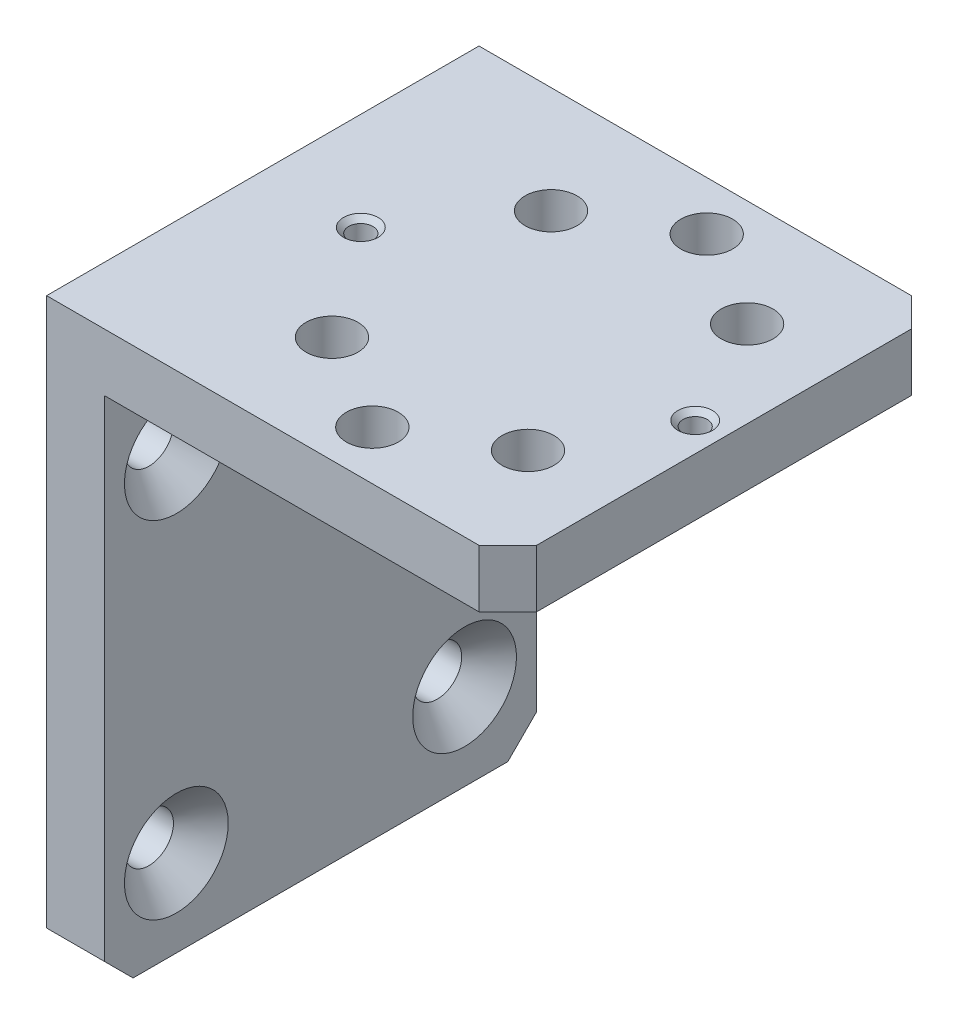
ISO-10303-21;
HEADER;
FILE_DESCRIPTION(('STEP AP214'),'2;1');
FILE_NAME('part.step','',(''),(''),'','','');
FILE_SCHEMA(('AUTOMOTIVE_DESIGN { 1 0 10303 214 1 1 1 1 }'));
ENDSEC;
DATA;
#1=APPLICATION_CONTEXT('core data for automotive mechanical design processes');
#2=APPLICATION_PROTOCOL_DEFINITION('international standard','automotive_design',2000,#1);
#3=PRODUCT_CONTEXT('',#1,'mechanical');
#4=PRODUCT('Part','Part','',(#3));
#5=PRODUCT_RELATED_PRODUCT_CATEGORY('part','',(#4));
#6=PRODUCT_DEFINITION_FORMATION('','',#4);
#7=PRODUCT_DEFINITION_CONTEXT('part definition',#1,'design');
#8=PRODUCT_DEFINITION('design','',#6,#7);
#9=PRODUCT_DEFINITION_SHAPE('','',#8);
#10=(LENGTH_UNIT() NAMED_UNIT(*) SI_UNIT(.MILLI.,.METRE.));
#11=(NAMED_UNIT(*) PLANE_ANGLE_UNIT() SI_UNIT($,.RADIAN.));
#12=(NAMED_UNIT(*) SI_UNIT($,.STERADIAN.) SOLID_ANGLE_UNIT());
#13=UNCERTAINTY_MEASURE_WITH_UNIT(LENGTH_MEASURE(1.E-05),#10,'distance_accuracy_value','');
#14=(GEOMETRIC_REPRESENTATION_CONTEXT(3) GLOBAL_UNCERTAINTY_ASSIGNED_CONTEXT((#13)) GLOBAL_UNIT_ASSIGNED_CONTEXT((#10,
#11,#12)) REPRESENTATION_CONTEXT('',''));
#15=CARTESIAN_POINT('',(0.,0.,0.));
#16=DIRECTION('',(0.,0.,1.));
#17=DIRECTION('',(1.,0.,0.));
#18=AXIS2_PLACEMENT_3D('',#15,#16,#17);
#19=CARTESIAN_POINT('',(0.,0.,37.5));
#20=DIRECTION('',(-1.,0.,0.));
#21=DIRECTION('',(0.,0.,1.));
#22=AXIS2_PLACEMENT_3D('',#19,#20,#21);
#23=PLANE('',#22);
#24=CARTESIAN_POINT('',(0.,75.,-25.));
#25=DIRECTION('',(1.,0.,0.));
#26=DIRECTION('',(0.,0.,-1.));
#27=AXIS2_PLACEMENT_3D('',#24,#25,#26);
#28=CIRCLE('',#27,4.25);
#29=CARTESIAN_POINT('',(0.,75.,-29.25));
#30=VERTEX_POINT('',#29);
#31=EDGE_CURVE('E179',#30,#30,#28,.T.);
#32=ORIENTED_EDGE('',*,*,#31,.T.);
#33=EDGE_LOOP('',(#32));
#34=FACE_BOUND('',#33,.T.);
#35=CARTESIAN_POINT('',(0.,15.,25.));
#36=DIRECTION('',(1.,0.,0.));
#37=DIRECTION('',(0.,0.,-1.));
#38=AXIS2_PLACEMENT_3D('',#35,#36,#37);
#39=CIRCLE('',#38,4.25);
#40=CARTESIAN_POINT('',(0.,15.,20.75));
#41=VERTEX_POINT('',#40);
#42=EDGE_CURVE('E197',#41,#41,#39,.T.);
#43=ORIENTED_EDGE('',*,*,#42,.T.);
#44=EDGE_LOOP('',(#43));
#45=FACE_BOUND('',#44,.T.);
#46=DIRECTION('',(0.,1.,0.));
#47=VECTOR('',#46,1.);
#48=CARTESIAN_POINT('',(0.,0.,-37.5));
#49=LINE('',#48,#47);
#50=CARTESIAN_POINT('',(0.,4.99999999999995,-37.5));
#51=VERTEX_POINT('',#50);
#52=CARTESIAN_POINT('',(0.,100.,-37.5));
#53=VERTEX_POINT('',#52);
#54=EDGE_CURVE('E210',#51,#53,#49,.T.);
#55=ORIENTED_EDGE('',*,*,#54,.F.);
#56=DIRECTION('',(0.,0.707106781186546,-0.707106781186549));
#57=VECTOR('',#56,1.);
#58=CARTESIAN_POINT('',(0.,-35.,2.50000000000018));
#59=LINE('',#58,#57);
#60=CARTESIAN_POINT('',(0.,0.,-32.5));
#61=VERTEX_POINT('',#60);
#62=EDGE_CURVE('E233',#51,#61,#59,.F.);
#63=ORIENTED_EDGE('',*,*,#62,.T.);
#64=DIRECTION('',(0.,0.,-1.));
#65=VECTOR('',#64,1.);
#66=CARTESIAN_POINT('',(0.,0.,37.5));
#67=LINE('',#66,#65);
#68=CARTESIAN_POINT('',(0.,0.,32.5));
#69=VERTEX_POINT('',#68);
#70=EDGE_CURVE('E222',#69,#61,#67,.T.);
#71=ORIENTED_EDGE('',*,*,#70,.F.);
#72=DIRECTION('',(0.,-0.707106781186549,-0.707106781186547));
#73=VECTOR('',#72,1.);
#74=CARTESIAN_POINT('',(0.,2.50000000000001,35.));
#75=LINE('',#74,#73);
#76=CARTESIAN_POINT('',(0.,5.00000000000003,37.5));
#77=VERTEX_POINT('',#76);
#78=EDGE_CURVE('E132',#69,#77,#75,.F.);
#79=ORIENTED_EDGE('',*,*,#78,.T.);
#80=DIRECTION('',(0.,1.,0.));
#81=VECTOR('',#80,1.);
#82=CARTESIAN_POINT('',(0.,0.,37.5));
#83=LINE('',#82,#81);
#84=CARTESIAN_POINT('',(0.,100.,37.5));
#85=VERTEX_POINT('',#84);
#86=EDGE_CURVE('E119',#77,#85,#83,.T.);
#87=ORIENTED_EDGE('',*,*,#86,.T.);
#88=DIRECTION('',(0.,0.,1.));
#89=VECTOR('',#88,1.);
#90=CARTESIAN_POINT('',(0.,100.,-37.5));
#91=LINE('',#90,#89);
#92=EDGE_CURVE('E130',#53,#85,#91,.T.);
#93=ORIENTED_EDGE('',*,*,#92,.F.);
#94=EDGE_LOOP('',(#55,#63,#71,#79,#87,#93));
#95=FACE_BOUND('',#94,.T.);
#96=CARTESIAN_POINT('',(0.,75.,25.));
#97=DIRECTION('',(1.,0.,0.));
#98=DIRECTION('',(0.,0.,-1.));
#99=AXIS2_PLACEMENT_3D('',#96,#97,#98);
#100=CIRCLE('',#99,4.25);
#101=CARTESIAN_POINT('',(0.,75.,20.75));
#102=VERTEX_POINT('',#101);
#103=EDGE_CURVE('E188',#102,#102,#100,.T.);
#104=ORIENTED_EDGE('',*,*,#103,.T.);
#105=EDGE_LOOP('',(#104));
#106=FACE_BOUND('',#105,.T.);
#107=CARTESIAN_POINT('',(0.,15.,-25.));
#108=DIRECTION('',(1.,0.,0.));
#109=DIRECTION('',(0.,0.,-1.));
#110=AXIS2_PLACEMENT_3D('',#107,#108,#109);
#111=CIRCLE('',#110,4.25);
#112=CARTESIAN_POINT('',(0.,15.,-29.25));
#113=VERTEX_POINT('',#112);
#114=EDGE_CURVE('E170',#113,#113,#111,.T.);
#115=ORIENTED_EDGE('',*,*,#114,.T.);
#116=EDGE_LOOP('',(#115));
#117=FACE_BOUND('',#116,.T.);
#118=ADVANCED_FACE('F38',(#34,#45,#95,#106,#117),#23,.T.);
#119=CARTESIAN_POINT('',(0.,90.,37.5));
#120=DIRECTION('',(0.,1.,0.));
#121=DIRECTION('',(0.,0.,1.));
#122=AXIS2_PLACEMENT_3D('',#119,#120,#121);
#123=PLANE('',#122);
#124=CARTESIAN_POINT('',(17.,90.,0.));
#125=DIRECTION('',(0.,1.,0.));
#126=DIRECTION('',(0.,0.,1.));
#127=AXIS2_PLACEMENT_3D('',#124,#125,#126);
#128=CIRCLE('',#127,2.09999999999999);
#129=CARTESIAN_POINT('',(17.,90.,2.09999999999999));
#130=VERTEX_POINT('',#129);
#131=EDGE_CURVE('E42',#130,#130,#128,.T.);
#132=ORIENTED_EDGE('',*,*,#131,.T.);
#133=EDGE_LOOP('',(#132));
#134=FACE_BOUND('',#133,.T.);
#135=CARTESIAN_POINT('',(75.,90.,0.));
#136=DIRECTION('',(0.,1.,0.));
#137=DIRECTION('',(0.,0.,1.));
#138=AXIS2_PLACEMENT_3D('',#135,#136,#137);
#139=CIRCLE('',#138,2.1);
#140=CARTESIAN_POINT('',(75.,90.,2.1));
#141=VERTEX_POINT('',#140);
#142=EDGE_CURVE('E259',#141,#141,#139,.T.);
#143=ORIENTED_EDGE('',*,*,#142,.T.);
#144=EDGE_LOOP('',(#143));
#145=FACE_BOUND('',#144,.T.);
#146=CARTESIAN_POINT('',(48.,90.,-29.));
#147=DIRECTION('',(0.,1.,0.));
#148=DIRECTION('',(0.,0.,1.));
#149=AXIS2_PLACEMENT_3D('',#146,#147,#148);
#150=CIRCLE('',#149,4.49999999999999);
#151=CARTESIAN_POINT('',(48.,90.,-24.5));
#152=VERTEX_POINT('',#151);
#153=EDGE_CURVE('E266',#152,#152,#150,.T.);
#154=ORIENTED_EDGE('',*,*,#153,.T.);
#155=EDGE_LOOP('',(#154));
#156=FACE_BOUND('',#155,.T.);
#157=CARTESIAN_POINT('',(48.,90.,29.));
#158=DIRECTION('',(0.,1.,0.));
#159=DIRECTION('',(0.,0.,1.));
#160=AXIS2_PLACEMENT_3D('',#157,#158,#159);
#161=CIRCLE('',#160,4.49999999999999);
#162=CARTESIAN_POINT('',(48.,90.,33.5));
#163=VERTEX_POINT('',#162);
#164=EDGE_CURVE('E140',#163,#163,#161,.T.);
#165=ORIENTED_EDGE('',*,*,#164,.T.);
#166=EDGE_LOOP('',(#165));
#167=FACE_BOUND('',#166,.T.);
#168=CARTESIAN_POINT('',(65.,90.,19.));
#169=DIRECTION('',(0.,1.,0.));
#170=DIRECTION('',(0.,0.,1.));
#171=AXIS2_PLACEMENT_3D('',#168,#169,#170);
#172=CIRCLE('',#171,4.5);
#173=CARTESIAN_POINT('',(65.,90.,23.5));
#174=VERTEX_POINT('',#173);
#175=EDGE_CURVE('E143',#174,#174,#172,.T.);
#176=ORIENTED_EDGE('',*,*,#175,.T.);
#177=EDGE_LOOP('',(#176));
#178=FACE_BOUND('',#177,.T.);
#179=CARTESIAN_POINT('',(31.,90.,19.));
#180=DIRECTION('',(0.,1.,0.));
#181=DIRECTION('',(0.,0.,1.));
#182=AXIS2_PLACEMENT_3D('',#179,#180,#181);
#183=CIRCLE('',#182,4.5);
#184=CARTESIAN_POINT('',(31.,90.,23.5));
#185=VERTEX_POINT('',#184);
#186=EDGE_CURVE('E155',#185,#185,#183,.T.);
#187=ORIENTED_EDGE('',*,*,#186,.T.);
#188=EDGE_LOOP('',(#187));
#189=FACE_BOUND('',#188,.T.);
#190=CARTESIAN_POINT('',(31.,90.,-19.));
#191=DIRECTION('',(0.,1.,0.));
#192=DIRECTION('',(0.,0.,1.));
#193=AXIS2_PLACEMENT_3D('',#190,#191,#192);
#194=CIRCLE('',#193,4.5);
#195=CARTESIAN_POINT('',(31.,90.,-14.5));
#196=VERTEX_POINT('',#195);
#197=EDGE_CURVE('E161',#196,#196,#194,.T.);
#198=ORIENTED_EDGE('',*,*,#197,.T.);
#199=EDGE_LOOP('',(#198));
#200=FACE_BOUND('',#199,.T.);
#201=CARTESIAN_POINT('',(65.,90.,-19.));
#202=DIRECTION('',(0.,1.,0.));
#203=DIRECTION('',(0.,0.,1.));
#204=AXIS2_PLACEMENT_3D('',#201,#202,#203);
#205=CIRCLE('',#204,4.5);
#206=CARTESIAN_POINT('',(65.,90.,-14.5));
#207=VERTEX_POINT('',#206);
#208=EDGE_CURVE('E167',#207,#207,#205,.T.);
#209=ORIENTED_EDGE('',*,*,#208,.T.);
#210=EDGE_LOOP('',(#209));
#211=FACE_BOUND('',#210,.T.);
#212=DIRECTION('',(1.,0.,0.));
#213=VECTOR('',#212,1.);
#214=CARTESIAN_POINT('',(0.,90.,-37.5));
#215=LINE('',#214,#213);
#216=CARTESIAN_POINT('',(10.,90.,-37.5));
#217=VERTEX_POINT('',#216);
#218=CARTESIAN_POINT('',(75.,90.,-37.5));
#219=VERTEX_POINT('',#218);
#220=EDGE_CURVE('E206',#217,#219,#215,.T.);
#221=ORIENTED_EDGE('',*,*,#220,.T.);
#222=DIRECTION('',(0.707106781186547,0.,0.707106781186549));
#223=VECTOR('',#222,1.);
#224=CARTESIAN_POINT('',(75.,90.,-37.5));
#225=LINE('',#224,#223);
#226=CARTESIAN_POINT('',(80.,90.,-32.5));
#227=VERTEX_POINT('',#226);
#228=EDGE_CURVE('E251',#219,#227,#225,.T.);
#229=ORIENTED_EDGE('',*,*,#228,.T.);
#230=DIRECTION('',(0.,0.,-1.));
#231=VECTOR('',#230,1.);
#232=CARTESIAN_POINT('',(80.,90.,37.5));
#233=LINE('',#232,#231);
#234=CARTESIAN_POINT('',(80.,90.,32.5));
#235=VERTEX_POINT('',#234);
#236=EDGE_CURVE('E227',#235,#227,#233,.T.);
#237=ORIENTED_EDGE('',*,*,#236,.F.);
#238=DIRECTION('',(0.707106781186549,0.,-0.707106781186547));
#239=VECTOR('',#238,1.);
#240=CARTESIAN_POINT('',(80.,90.,32.5));
#241=LINE('',#240,#239);
#242=CARTESIAN_POINT('',(75.,90.,37.5));
#243=VERTEX_POINT('',#242);
#244=EDGE_CURVE('E249',#235,#243,#241,.F.);
#245=ORIENTED_EDGE('',*,*,#244,.T.);
#246=DIRECTION('',(1.,0.,0.));
#247=VECTOR('',#246,1.);
#248=CARTESIAN_POINT('',(0.,90.,37.5));
#249=LINE('',#248,#247);
#250=CARTESIAN_POINT('',(10.,90.,37.5));
#251=VERTEX_POINT('',#250);
#252=EDGE_CURVE('E124',#251,#243,#249,.T.);
#253=ORIENTED_EDGE('',*,*,#252,.F.);
#254=DIRECTION('',(0.,0.,-1.));
#255=VECTOR('',#254,1.);
#256=CARTESIAN_POINT('',(10.,90.,37.5));
#257=LINE('',#256,#255);
#258=EDGE_CURVE('E216',#251,#217,#257,.T.);
#259=ORIENTED_EDGE('',*,*,#258,.T.);
#260=EDGE_LOOP('',(#221,#229,#237,#245,#253,#259));
#261=FACE_BOUND('',#260,.T.);
#262=ADVANCED_FACE('F40',(#134,#145,#156,#167,#178,#189,#200,#211,#261),#123,.F.);
#263=CARTESIAN_POINT('',(80.,100.,37.5));
#264=DIRECTION('',(1.,0.,0.));
#265=DIRECTION('',(0.,0.,-1.));
#266=AXIS2_PLACEMENT_3D('',#263,#264,#265);
#267=PLANE('',#266);
#268=ORIENTED_EDGE('',*,*,#236,.T.);
#269=DIRECTION('',(0.,1.,0.));
#270=VECTOR('',#269,1.);
#271=CARTESIAN_POINT('',(80.,100.,-32.5));
#272=LINE('',#271,#270);
#273=CARTESIAN_POINT('',(80.,100.,-32.4999999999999));
#274=VERTEX_POINT('',#273);
#275=EDGE_CURVE('E61',#227,#274,#272,.T.);
#276=ORIENTED_EDGE('',*,*,#275,.T.);
#277=DIRECTION('',(0.,0.,-1.));
#278=VECTOR('',#277,1.);
#279=CARTESIAN_POINT('',(80.,100.,37.5));
#280=LINE('',#279,#278);
#281=CARTESIAN_POINT('',(80.,100.,32.5));
#282=VERTEX_POINT('',#281);
#283=EDGE_CURVE('E225',#282,#274,#280,.T.);
#284=ORIENTED_EDGE('',*,*,#283,.F.);
#285=DIRECTION('',(0.,-1.,0.));
#286=VECTOR('',#285,1.);
#287=CARTESIAN_POINT('',(80.,100.,32.5));
#288=LINE('',#287,#286);
#289=EDGE_CURVE('E253',#282,#235,#288,.T.);
#290=ORIENTED_EDGE('',*,*,#289,.T.);
#291=EDGE_LOOP('',(#268,#276,#284,#290));
#292=FACE_BOUND('',#291,.T.);
#293=ADVANCED_FACE('F287',(#292),#267,.T.);
#294=CARTESIAN_POINT('',(0.,100.,37.5));
#295=DIRECTION('',(0.,1.,0.));
#296=DIRECTION('',(0.,0.,1.));
#297=AXIS2_PLACEMENT_3D('',#294,#295,#296);
#298=PLANE('',#297);
#299=CARTESIAN_POINT('',(17.,100.,0.));
#300=DIRECTION('',(0.,1.,0.));
#301=DIRECTION('',(0.,0.,1.));
#302=AXIS2_PLACEMENT_3D('',#299,#300,#301);
#303=CIRCLE('',#302,3.);
#304=CARTESIAN_POINT('',(17.,100.,3.));
#305=VERTEX_POINT('',#304);
#306=EDGE_CURVE('E558',#305,#305,#303,.T.);
#307=ORIENTED_EDGE('',*,*,#306,.F.);
#308=EDGE_LOOP('',(#307));
#309=FACE_BOUND('',#308,.T.);
#310=CARTESIAN_POINT('',(75.,100.,0.));
#311=DIRECTION('',(0.,1.,0.));
#312=DIRECTION('',(0.,0.,1.));
#313=AXIS2_PLACEMENT_3D('',#310,#311,#312);
#314=CIRCLE('',#313,3.);
#315=CARTESIAN_POINT('',(75.,100.,3.));
#316=VERTEX_POINT('',#315);
#317=EDGE_CURVE('E262',#316,#316,#314,.T.);
#318=ORIENTED_EDGE('',*,*,#317,.F.);
#319=EDGE_LOOP('',(#318));
#320=FACE_BOUND('',#319,.T.);
#321=CARTESIAN_POINT('',(48.,100.,-29.));
#322=DIRECTION('',(0.,1.,0.));
#323=DIRECTION('',(0.,0.,1.));
#324=AXIS2_PLACEMENT_3D('',#321,#322,#323);
#325=CIRCLE('',#324,4.49999999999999);
#326=CARTESIAN_POINT('',(48.,100.,-24.5));
#327=VERTEX_POINT('',#326);
#328=EDGE_CURVE('E261',#327,#327,#325,.T.);
#329=ORIENTED_EDGE('',*,*,#328,.F.);
#330=EDGE_LOOP('',(#329));
#331=FACE_BOUND('',#330,.T.);
#332=CARTESIAN_POINT('',(48.,100.,29.));
#333=DIRECTION('',(0.,1.,0.));
#334=DIRECTION('',(0.,0.,1.));
#335=AXIS2_PLACEMENT_3D('',#332,#333,#334);
#336=CIRCLE('',#335,4.49999999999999);
#337=CARTESIAN_POINT('',(48.,100.,33.5));
#338=VERTEX_POINT('',#337);
#339=EDGE_CURVE('E146',#338,#338,#336,.T.);
#340=ORIENTED_EDGE('',*,*,#339,.F.);
#341=EDGE_LOOP('',(#340));
#342=FACE_BOUND('',#341,.T.);
#343=CARTESIAN_POINT('',(65.,100.,19.));
#344=DIRECTION('',(0.,1.,0.));
#345=DIRECTION('',(0.,0.,1.));
#346=AXIS2_PLACEMENT_3D('',#343,#344,#345);
#347=CIRCLE('',#346,4.5);
#348=CARTESIAN_POINT('',(65.,100.,23.5));
#349=VERTEX_POINT('',#348);
#350=EDGE_CURVE('E139',#349,#349,#347,.T.);
#351=ORIENTED_EDGE('',*,*,#350,.F.);
#352=EDGE_LOOP('',(#351));
#353=FACE_BOUND('',#352,.T.);
#354=CARTESIAN_POINT('',(31.,100.,19.));
#355=DIRECTION('',(0.,1.,0.));
#356=DIRECTION('',(0.,0.,1.));
#357=AXIS2_PLACEMENT_3D('',#354,#355,#356);
#358=CIRCLE('',#357,4.5);
#359=CARTESIAN_POINT('',(31.,100.,23.5));
#360=VERTEX_POINT('',#359);
#361=EDGE_CURVE('E152',#360,#360,#358,.T.);
#362=ORIENTED_EDGE('',*,*,#361,.F.);
#363=EDGE_LOOP('',(#362));
#364=FACE_BOUND('',#363,.T.);
#365=CARTESIAN_POINT('',(31.,100.,-19.));
#366=DIRECTION('',(0.,1.,0.));
#367=DIRECTION('',(0.,0.,1.));
#368=AXIS2_PLACEMENT_3D('',#365,#366,#367);
#369=CIRCLE('',#368,4.5);
#370=CARTESIAN_POINT('',(31.,100.,-14.5));
#371=VERTEX_POINT('',#370);
#372=EDGE_CURVE('E158',#371,#371,#369,.T.);
#373=ORIENTED_EDGE('',*,*,#372,.F.);
#374=EDGE_LOOP('',(#373));
#375=FACE_BOUND('',#374,.T.);
#376=CARTESIAN_POINT('',(65.,100.,-19.));
#377=DIRECTION('',(0.,1.,0.));
#378=DIRECTION('',(0.,0.,1.));
#379=AXIS2_PLACEMENT_3D('',#376,#377,#378);
#380=CIRCLE('',#379,4.5);
#381=CARTESIAN_POINT('',(65.,100.,-14.5));
#382=VERTEX_POINT('',#381);
#383=EDGE_CURVE('E164',#382,#382,#380,.T.);
#384=ORIENTED_EDGE('',*,*,#383,.F.);
#385=EDGE_LOOP('',(#384));
#386=FACE_BOUND('',#385,.T.);
#387=ORIENTED_EDGE('',*,*,#283,.T.);
#388=DIRECTION('',(-0.707106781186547,0.,-0.707106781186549));
#389=VECTOR('',#388,1.);
#390=CARTESIAN_POINT('',(75.0000000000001,100.,-37.4999999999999));
#391=LINE('',#390,#389);
#392=CARTESIAN_POINT('',(75.,100.,-37.5));
#393=VERTEX_POINT('',#392);
#394=EDGE_CURVE('E47',#274,#393,#391,.T.);
#395=ORIENTED_EDGE('',*,*,#394,.T.);
#396=DIRECTION('',(1.,0.,0.));
#397=VECTOR('',#396,1.);
#398=CARTESIAN_POINT('',(0.,100.,-37.5));
#399=LINE('',#398,#397);
#400=EDGE_CURVE('E138',#53,#393,#399,.T.);
#401=ORIENTED_EDGE('',*,*,#400,.F.);
#402=ORIENTED_EDGE('',*,*,#92,.T.);
#403=DIRECTION('',(1.,0.,0.));
#404=VECTOR('',#403,1.);
#405=CARTESIAN_POINT('',(0.,100.,37.5));
#406=LINE('',#405,#404);
#407=CARTESIAN_POINT('',(75.,100.,37.5));
#408=VERTEX_POINT('',#407);
#409=EDGE_CURVE('E116',#85,#408,#406,.T.);
#410=ORIENTED_EDGE('',*,*,#409,.T.);
#411=DIRECTION('',(-0.707106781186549,0.,0.707106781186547));
#412=VECTOR('',#411,1.);
#413=CARTESIAN_POINT('',(37.4999999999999,100.,75.));
#414=LINE('',#413,#412);
#415=EDGE_CURVE('E257',#408,#282,#414,.F.);
#416=ORIENTED_EDGE('',*,*,#415,.T.);
#417=EDGE_LOOP('',(#387,#395,#401,#402,#410,#416));
#418=FACE_BOUND('',#417,.T.);
#419=ADVANCED_FACE('F136',(#309,#320,#331,#342,#353,#364,#375,#386,#418),#298,.T.);
#420=CARTESIAN_POINT('',(10.,0.,37.5));
#421=DIRECTION('',(0.,-1.,0.));
#422=DIRECTION('',(0.,0.,-1.));
#423=AXIS2_PLACEMENT_3D('',#420,#421,#422);
#424=PLANE('',#423);
#425=ORIENTED_EDGE('',*,*,#70,.T.);
#426=DIRECTION('',(1.,0.,0.));
#427=VECTOR('',#426,1.);
#428=CARTESIAN_POINT('',(10.,0.,-32.5));
#429=LINE('',#428,#427);
#430=CARTESIAN_POINT('',(10.,0.,-32.5));
#431=VERTEX_POINT('',#430);
#432=EDGE_CURVE('E238',#61,#431,#429,.T.);
#433=ORIENTED_EDGE('',*,*,#432,.T.);
#434=DIRECTION('',(0.,0.,-1.));
#435=VECTOR('',#434,1.);
#436=CARTESIAN_POINT('',(10.,0.,37.5));
#437=LINE('',#436,#435);
#438=CARTESIAN_POINT('',(10.,0.,32.5));
#439=VERTEX_POINT('',#438);
#440=EDGE_CURVE('E219',#439,#431,#437,.T.);
#441=ORIENTED_EDGE('',*,*,#440,.F.);
#442=DIRECTION('',(-1.,0.,0.));
#443=VECTOR('',#442,1.);
#444=CARTESIAN_POINT('',(10.,0.,32.5));
#445=LINE('',#444,#443);
#446=EDGE_CURVE('E235',#439,#69,#445,.T.);
#447=ORIENTED_EDGE('',*,*,#446,.T.);
#448=EDGE_LOOP('',(#425,#433,#441,#447));
#449=FACE_BOUND('',#448,.T.);
#450=ADVANCED_FACE('F286',(#449),#424,.T.);
#451=CARTESIAN_POINT('',(10.,0.,37.5));
#452=DIRECTION('',(-1.,0.,0.));
#453=DIRECTION('',(0.,0.,1.));
#454=AXIS2_PLACEMENT_3D('',#451,#452,#453);
#455=PLANE('',#454);
#456=CARTESIAN_POINT('',(10.,15.,-25.));
#457=DIRECTION('',(1.,0.,0.));
#458=DIRECTION('',(0.,0.,-1.));
#459=AXIS2_PLACEMENT_3D('',#456,#457,#458);
#460=CIRCLE('',#459,9.);
#461=CARTESIAN_POINT('',(10.,15.,-34.));
#462=VERTEX_POINT('',#461);
#463=EDGE_CURVE('E176',#462,#462,#460,.T.);
#464=ORIENTED_EDGE('',*,*,#463,.F.);
#465=EDGE_LOOP('',(#464));
#466=FACE_BOUND('',#465,.T.);
#467=CARTESIAN_POINT('',(10.,75.,-25.));
#468=DIRECTION('',(1.,0.,0.));
#469=DIRECTION('',(0.,0.,-1.));
#470=AXIS2_PLACEMENT_3D('',#467,#468,#469);
#471=CIRCLE('',#470,8.99999999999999);
#472=CARTESIAN_POINT('',(10.,75.,-34.));
#473=VERTEX_POINT('',#472);
#474=EDGE_CURVE('E185',#473,#473,#471,.T.);
#475=ORIENTED_EDGE('',*,*,#474,.F.);
#476=EDGE_LOOP('',(#475));
#477=FACE_BOUND('',#476,.T.);
#478=CARTESIAN_POINT('',(10.,75.,25.));
#479=DIRECTION('',(1.,0.,0.));
#480=DIRECTION('',(0.,0.,-1.));
#481=AXIS2_PLACEMENT_3D('',#478,#479,#480);
#482=CIRCLE('',#481,8.99999999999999);
#483=CARTESIAN_POINT('',(10.,75.,16.));
#484=VERTEX_POINT('',#483);
#485=EDGE_CURVE('E194',#484,#484,#482,.T.);
#486=ORIENTED_EDGE('',*,*,#485,.F.);
#487=EDGE_LOOP('',(#486));
#488=FACE_BOUND('',#487,.T.);
#489=CARTESIAN_POINT('',(10.,15.,25.));
#490=DIRECTION('',(1.,0.,0.));
#491=DIRECTION('',(0.,0.,-1.));
#492=AXIS2_PLACEMENT_3D('',#489,#490,#491);
#493=CIRCLE('',#492,9.);
#494=CARTESIAN_POINT('',(10.,15.,16.));
#495=VERTEX_POINT('',#494);
#496=EDGE_CURVE('E203',#495,#495,#493,.T.);
#497=ORIENTED_EDGE('',*,*,#496,.F.);
#498=EDGE_LOOP('',(#497));
#499=FACE_BOUND('',#498,.T.);
#500=ORIENTED_EDGE('',*,*,#440,.T.);
#501=DIRECTION('',(0.,-0.707106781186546,0.707106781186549));
#502=VECTOR('',#501,1.);
#503=CARTESIAN_POINT('',(10.,4.99999999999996,-37.5));
#504=LINE('',#503,#502);
#505=CARTESIAN_POINT('',(10.,4.99999999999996,-37.5));
#506=VERTEX_POINT('',#505);
#507=EDGE_CURVE('E242',#431,#506,#504,.F.);
#508=ORIENTED_EDGE('',*,*,#507,.T.);
#509=DIRECTION('',(0.,1.,0.));
#510=VECTOR('',#509,1.);
#511=CARTESIAN_POINT('',(10.,0.,-37.5));
#512=LINE('',#511,#510);
#513=EDGE_CURVE('E212',#506,#217,#512,.T.);
#514=ORIENTED_EDGE('',*,*,#513,.T.);
#515=ORIENTED_EDGE('',*,*,#258,.F.);
#516=DIRECTION('',(0.,1.,0.));
#517=VECTOR('',#516,1.);
#518=CARTESIAN_POINT('',(10.,0.,37.5));
#519=LINE('',#518,#517);
#520=CARTESIAN_POINT('',(10.,5.00000000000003,37.5));
#521=VERTEX_POINT('',#520);
#522=EDGE_CURVE('E133',#521,#251,#519,.T.);
#523=ORIENTED_EDGE('',*,*,#522,.F.);
#524=DIRECTION('',(0.,0.707106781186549,0.707106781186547));
#525=VECTOR('',#524,1.);
#526=CARTESIAN_POINT('',(10.,0.,32.5));
#527=LINE('',#526,#525);
#528=EDGE_CURVE('E240',#521,#439,#527,.F.);
#529=ORIENTED_EDGE('',*,*,#528,.T.);
#530=EDGE_LOOP('',(#500,#508,#514,#515,#523,#529));
#531=FACE_BOUND('',#530,.T.);
#532=ADVANCED_FACE('F348',(#466,#477,#488,#499,#531),#455,.F.);
#533=CARTESIAN_POINT('',(10.,90.,37.5));
#534=DIRECTION('',(0.,0.,1.));
#535=DIRECTION('',(1.,0.,0.));
#536=AXIS2_PLACEMENT_3D('',#533,#534,#535);
#537=PLANE('',#536);
#538=ORIENTED_EDGE('',*,*,#86,.F.);
#539=DIRECTION('',(1.,0.,0.));
#540=VECTOR('',#539,1.);
#541=CARTESIAN_POINT('',(10.,5.00000000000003,37.5));
#542=LINE('',#541,#540);
#543=EDGE_CURVE('E244',#77,#521,#542,.T.);
#544=ORIENTED_EDGE('',*,*,#543,.T.);
#545=ORIENTED_EDGE('',*,*,#522,.T.);
#546=ORIENTED_EDGE('',*,*,#252,.T.);
#547=DIRECTION('',(0.,1.,0.));
#548=VECTOR('',#547,1.);
#549=CARTESIAN_POINT('',(75.,90.,37.5));
#550=LINE('',#549,#548);
#551=EDGE_CURVE('E11',#243,#408,#550,.T.);
#552=ORIENTED_EDGE('',*,*,#551,.T.);
#553=ORIENTED_EDGE('',*,*,#409,.F.);
#554=EDGE_LOOP('',(#538,#544,#545,#546,#552,#553));
#555=FACE_BOUND('',#554,.T.);
#556=ADVANCED_FACE('F118',(#555),#537,.T.);
#557=CARTESIAN_POINT('',(10.,90.,-37.5));
#558=DIRECTION('',(0.,0.,1.));
#559=DIRECTION('',(1.,0.,0.));
#560=AXIS2_PLACEMENT_3D('',#557,#558,#559);
#561=PLANE('',#560);
#562=ORIENTED_EDGE('',*,*,#400,.T.);
#563=DIRECTION('',(0.,-1.,0.));
#564=VECTOR('',#563,1.);
#565=CARTESIAN_POINT('',(75.,90.,-37.5));
#566=LINE('',#565,#564);
#567=EDGE_CURVE('E246',#393,#219,#566,.T.);
#568=ORIENTED_EDGE('',*,*,#567,.T.);
#569=ORIENTED_EDGE('',*,*,#220,.F.);
#570=ORIENTED_EDGE('',*,*,#513,.F.);
#571=DIRECTION('',(-1.,0.,0.));
#572=VECTOR('',#571,1.);
#573=CARTESIAN_POINT('',(10.,4.99999999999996,-37.5));
#574=LINE('',#573,#572);
#575=EDGE_CURVE('E229',#506,#51,#574,.T.);
#576=ORIENTED_EDGE('',*,*,#575,.T.);
#577=ORIENTED_EDGE('',*,*,#54,.T.);
#578=EDGE_LOOP('',(#562,#568,#569,#570,#576,#577));
#579=FACE_BOUND('',#578,.T.);
#580=ADVANCED_FACE('F336',(#579),#561,.F.);
#581=CARTESIAN_POINT('',(10.,4.99999999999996,-37.5));
#582=DIRECTION('',(0.,0.707106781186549,0.707106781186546));
#583=DIRECTION('',(0.,-0.707106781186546,0.707106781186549));
#584=AXIS2_PLACEMENT_3D('',#581,#582,#583);
#585=PLANE('',#584);
#586=ORIENTED_EDGE('',*,*,#507,.F.);
#587=ORIENTED_EDGE('',*,*,#432,.F.);
#588=ORIENTED_EDGE('',*,*,#62,.F.);
#589=ORIENTED_EDGE('',*,*,#575,.F.);
#590=EDGE_LOOP('',(#586,#587,#588,#589));
#591=FACE_BOUND('',#590,.T.);
#592=ADVANCED_FACE('F346',(#591),#585,.F.);
#593=CARTESIAN_POINT('',(10.,0.,32.5));
#594=DIRECTION('',(0.,0.707106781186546,-0.707106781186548));
#595=DIRECTION('',(0.,0.707106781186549,0.707106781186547));
#596=AXIS2_PLACEMENT_3D('',#593,#594,#595);
#597=PLANE('',#596);
#598=ORIENTED_EDGE('',*,*,#528,.F.);
#599=ORIENTED_EDGE('',*,*,#543,.F.);
#600=ORIENTED_EDGE('',*,*,#78,.F.);
#601=ORIENTED_EDGE('',*,*,#446,.F.);
#602=EDGE_LOOP('',(#598,#599,#600,#601));
#603=FACE_BOUND('',#602,.T.);
#604=ADVANCED_FACE('F354',(#603),#597,.F.);
#605=CARTESIAN_POINT('',(75.,90.,-37.5));
#606=DIRECTION('',(0.707106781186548,0.,-0.707106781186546));
#607=DIRECTION('',(-0.707106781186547,0.,-0.707106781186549));
#608=AXIS2_PLACEMENT_3D('',#605,#606,#607);
#609=PLANE('',#608);
#610=ORIENTED_EDGE('',*,*,#394,.F.);
#611=ORIENTED_EDGE('',*,*,#275,.F.);
#612=ORIENTED_EDGE('',*,*,#228,.F.);
#613=ORIENTED_EDGE('',*,*,#567,.F.);
#614=EDGE_LOOP('',(#610,#611,#612,#613));
#615=FACE_BOUND('',#614,.T.);
#616=ADVANCED_FACE('F333',(#615),#609,.T.);
#617=CARTESIAN_POINT('',(80.,100.,32.5));
#618=DIRECTION('',(-0.707106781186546,0.,-0.707106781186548));
#619=DIRECTION('',(-0.707106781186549,0.,0.707106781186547));
#620=AXIS2_PLACEMENT_3D('',#617,#618,#619);
#621=PLANE('',#620);
#622=ORIENTED_EDGE('',*,*,#415,.F.);
#623=ORIENTED_EDGE('',*,*,#551,.F.);
#624=ORIENTED_EDGE('',*,*,#244,.F.);
#625=ORIENTED_EDGE('',*,*,#289,.F.);
#626=EDGE_LOOP('',(#622,#623,#624,#625));
#627=FACE_BOUND('',#626,.T.);
#628=ADVANCED_FACE('F361',(#627),#621,.F.);
#629=CARTESIAN_POINT('',(10.,15.,25.));
#630=DIRECTION('',(1.,0.,0.));
#631=DIRECTION('',(0.,0.,-1.));
#632=AXIS2_PLACEMENT_3D('',#629,#630,#631);
#633=CONICAL_SURFACE('',#632,9.,0.785398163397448);
#634=CARTESIAN_POINT('',(5.25,15.,25.));
#635=DIRECTION('',(1.,0.,0.));
#636=DIRECTION('',(0.,0.,-1.));
#637=AXIS2_PLACEMENT_3D('',#634,#635,#636);
#638=CIRCLE('',#637,4.25);
#639=CARTESIAN_POINT('',(5.25,15.,20.75));
#640=VERTEX_POINT('',#639);
#641=EDGE_CURVE('E200',#640,#640,#638,.T.);
#642=ORIENTED_EDGE('',*,*,#641,.F.);
#643=EDGE_LOOP('',(#642));
#644=FACE_BOUND('',#643,.T.);
#645=ORIENTED_EDGE('',*,*,#496,.T.);
#646=EDGE_LOOP('',(#645));
#647=FACE_BOUND('',#646,.T.);
#648=ADVANCED_FACE('F382',(#644,#647),#633,.F.);
#649=CARTESIAN_POINT('',(10.,15.,25.));
#650=DIRECTION('',(1.,0.,0.));
#651=DIRECTION('',(0.,0.,-1.));
#652=AXIS2_PLACEMENT_3D('',#649,#650,#651);
#653=CYLINDRICAL_SURFACE('',#652,4.25);
#654=ORIENTED_EDGE('',*,*,#42,.F.);
#655=EDGE_LOOP('',(#654));
#656=FACE_BOUND('',#655,.T.);
#657=ORIENTED_EDGE('',*,*,#641,.T.);
#658=EDGE_LOOP('',(#657));
#659=FACE_BOUND('',#658,.T.);
#660=ADVANCED_FACE('F384',(#656,#659),#653,.F.);
#661=CARTESIAN_POINT('',(10.,75.,25.));
#662=DIRECTION('',(1.,0.,0.));
#663=DIRECTION('',(0.,0.,-1.));
#664=AXIS2_PLACEMENT_3D('',#661,#662,#663);
#665=CONICAL_SURFACE('',#664,8.99999999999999,0.785398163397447);
#666=CARTESIAN_POINT('',(5.25,75.,25.));
#667=DIRECTION('',(1.,0.,0.));
#668=DIRECTION('',(0.,0.,-1.));
#669=AXIS2_PLACEMENT_3D('',#666,#667,#668);
#670=CIRCLE('',#669,4.25);
#671=CARTESIAN_POINT('',(5.25,75.,20.75));
#672=VERTEX_POINT('',#671);
#673=EDGE_CURVE('E191',#672,#672,#670,.T.);
#674=ORIENTED_EDGE('',*,*,#673,.F.);
#675=EDGE_LOOP('',(#674));
#676=FACE_BOUND('',#675,.T.);
#677=ORIENTED_EDGE('',*,*,#485,.T.);
#678=EDGE_LOOP('',(#677));
#679=FACE_BOUND('',#678,.T.);
#680=ADVANCED_FACE('F391',(#676,#679),#665,.F.);
#681=CARTESIAN_POINT('',(10.,75.,25.));
#682=DIRECTION('',(1.,0.,0.));
#683=DIRECTION('',(0.,0.,-1.));
#684=AXIS2_PLACEMENT_3D('',#681,#682,#683);
#685=CYLINDRICAL_SURFACE('',#684,4.25);
#686=ORIENTED_EDGE('',*,*,#103,.F.);
#687=EDGE_LOOP('',(#686));
#688=FACE_BOUND('',#687,.T.);
#689=ORIENTED_EDGE('',*,*,#673,.T.);
#690=EDGE_LOOP('',(#689));
#691=FACE_BOUND('',#690,.T.);
#692=ADVANCED_FACE('F399',(#688,#691),#685,.F.);
#693=CARTESIAN_POINT('',(10.,75.,-25.));
#694=DIRECTION('',(1.,0.,0.));
#695=DIRECTION('',(0.,0.,-1.));
#696=AXIS2_PLACEMENT_3D('',#693,#694,#695);
#697=CONICAL_SURFACE('',#696,8.99999999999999,0.785398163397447);
#698=CARTESIAN_POINT('',(5.25,75.,-25.));
#699=DIRECTION('',(1.,0.,0.));
#700=DIRECTION('',(0.,0.,-1.));
#701=AXIS2_PLACEMENT_3D('',#698,#699,#700);
#702=CIRCLE('',#701,4.25);
#703=CARTESIAN_POINT('',(5.25,75.,-29.25));
#704=VERTEX_POINT('',#703);
#705=EDGE_CURVE('E182',#704,#704,#702,.T.);
#706=ORIENTED_EDGE('',*,*,#705,.F.);
#707=EDGE_LOOP('',(#706));
#708=FACE_BOUND('',#707,.T.);
#709=ORIENTED_EDGE('',*,*,#474,.T.);
#710=EDGE_LOOP('',(#709));
#711=FACE_BOUND('',#710,.T.);
#712=ADVANCED_FACE('F403',(#708,#711),#697,.F.);
#713=CARTESIAN_POINT('',(10.,75.,-25.));
#714=DIRECTION('',(1.,0.,0.));
#715=DIRECTION('',(0.,0.,-1.));
#716=AXIS2_PLACEMENT_3D('',#713,#714,#715);
#717=CYLINDRICAL_SURFACE('',#716,4.25);
#718=ORIENTED_EDGE('',*,*,#31,.F.);
#719=EDGE_LOOP('',(#718));
#720=FACE_BOUND('',#719,.T.);
#721=ORIENTED_EDGE('',*,*,#705,.T.);
#722=EDGE_LOOP('',(#721));
#723=FACE_BOUND('',#722,.T.);
#724=ADVANCED_FACE('F407',(#720,#723),#717,.F.);
#725=CARTESIAN_POINT('',(10.,15.,-25.));
#726=DIRECTION('',(1.,0.,0.));
#727=DIRECTION('',(0.,0.,-1.));
#728=AXIS2_PLACEMENT_3D('',#725,#726,#727);
#729=CONICAL_SURFACE('',#728,9.,0.785398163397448);
#730=CARTESIAN_POINT('',(5.25,15.,-25.));
#731=DIRECTION('',(1.,0.,0.));
#732=DIRECTION('',(0.,0.,-1.));
#733=AXIS2_PLACEMENT_3D('',#730,#731,#732);
#734=CIRCLE('',#733,4.25);
#735=CARTESIAN_POINT('',(5.25,15.,-29.25));
#736=VERTEX_POINT('',#735);
#737=EDGE_CURVE('E173',#736,#736,#734,.T.);
#738=ORIENTED_EDGE('',*,*,#737,.F.);
#739=EDGE_LOOP('',(#738));
#740=FACE_BOUND('',#739,.T.);
#741=ORIENTED_EDGE('',*,*,#463,.T.);
#742=EDGE_LOOP('',(#741));
#743=FACE_BOUND('',#742,.T.);
#744=ADVANCED_FACE('F311',(#740,#743),#729,.F.);
#745=CARTESIAN_POINT('',(10.,15.,-25.));
#746=DIRECTION('',(1.,0.,0.));
#747=DIRECTION('',(0.,0.,-1.));
#748=AXIS2_PLACEMENT_3D('',#745,#746,#747);
#749=CYLINDRICAL_SURFACE('',#748,4.25);
#750=ORIENTED_EDGE('',*,*,#114,.F.);
#751=EDGE_LOOP('',(#750));
#752=FACE_BOUND('',#751,.T.);
#753=ORIENTED_EDGE('',*,*,#737,.T.);
#754=EDGE_LOOP('',(#753));
#755=FACE_BOUND('',#754,.T.);
#756=ADVANCED_FACE('F301',(#752,#755),#749,.F.);
#757=CARTESIAN_POINT('',(65.,100.,-19.));
#758=DIRECTION('',(0.,1.,0.));
#759=DIRECTION('',(0.,0.,1.));
#760=AXIS2_PLACEMENT_3D('',#757,#758,#759);
#761=CYLINDRICAL_SURFACE('',#760,4.5);
#762=ORIENTED_EDGE('',*,*,#208,.F.);
#763=EDGE_LOOP('',(#762));
#764=FACE_BOUND('',#763,.T.);
#765=ORIENTED_EDGE('',*,*,#383,.T.);
#766=EDGE_LOOP('',(#765));
#767=FACE_BOUND('',#766,.T.);
#768=ADVANCED_FACE('F298',(#764,#767),#761,.F.);
#769=CARTESIAN_POINT('',(31.,100.,-19.));
#770=DIRECTION('',(0.,1.,0.));
#771=DIRECTION('',(0.,0.,1.));
#772=AXIS2_PLACEMENT_3D('',#769,#770,#771);
#773=CYLINDRICAL_SURFACE('',#772,4.5);
#774=ORIENTED_EDGE('',*,*,#197,.F.);
#775=EDGE_LOOP('',(#774));
#776=FACE_BOUND('',#775,.T.);
#777=ORIENTED_EDGE('',*,*,#372,.T.);
#778=EDGE_LOOP('',(#777));
#779=FACE_BOUND('',#778,.T.);
#780=ADVANCED_FACE('F300',(#776,#779),#773,.F.);
#781=CARTESIAN_POINT('',(31.,100.,19.));
#782=DIRECTION('',(0.,1.,0.));
#783=DIRECTION('',(0.,0.,1.));
#784=AXIS2_PLACEMENT_3D('',#781,#782,#783);
#785=CYLINDRICAL_SURFACE('',#784,4.5);
#786=ORIENTED_EDGE('',*,*,#186,.F.);
#787=EDGE_LOOP('',(#786));
#788=FACE_BOUND('',#787,.T.);
#789=ORIENTED_EDGE('',*,*,#361,.T.);
#790=EDGE_LOOP('',(#789));
#791=FACE_BOUND('',#790,.T.);
#792=ADVANCED_FACE('F308',(#788,#791),#785,.F.);
#793=CARTESIAN_POINT('',(65.,100.,19.));
#794=DIRECTION('',(0.,1.,0.));
#795=DIRECTION('',(0.,0.,1.));
#796=AXIS2_PLACEMENT_3D('',#793,#794,#795);
#797=CYLINDRICAL_SURFACE('',#796,4.5);
#798=ORIENTED_EDGE('',*,*,#175,.F.);
#799=EDGE_LOOP('',(#798));
#800=FACE_BOUND('',#799,.T.);
#801=ORIENTED_EDGE('',*,*,#350,.T.);
#802=EDGE_LOOP('',(#801));
#803=FACE_BOUND('',#802,.T.);
#804=ADVANCED_FACE('F444',(#800,#803),#797,.F.);
#805=CARTESIAN_POINT('',(48.,100.,29.));
#806=DIRECTION('',(0.,1.,0.));
#807=DIRECTION('',(0.,0.,1.));
#808=AXIS2_PLACEMENT_3D('',#805,#806,#807);
#809=CYLINDRICAL_SURFACE('',#808,4.49999999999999);
#810=ORIENTED_EDGE('',*,*,#339,.T.);
#811=EDGE_LOOP('',(#810));
#812=FACE_BOUND('',#811,.T.);
#813=ORIENTED_EDGE('',*,*,#164,.F.);
#814=EDGE_LOOP('',(#813));
#815=FACE_BOUND('',#814,.T.);
#816=ADVANCED_FACE('F281',(#812,#815),#809,.F.);
#817=CARTESIAN_POINT('',(48.,100.,-29.));
#818=DIRECTION('',(0.,1.,0.));
#819=DIRECTION('',(0.,0.,1.));
#820=AXIS2_PLACEMENT_3D('',#817,#818,#819);
#821=CYLINDRICAL_SURFACE('',#820,4.49999999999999);
#822=ORIENTED_EDGE('',*,*,#328,.T.);
#823=EDGE_LOOP('',(#822));
#824=FACE_BOUND('',#823,.T.);
#825=ORIENTED_EDGE('',*,*,#153,.F.);
#826=EDGE_LOOP('',(#825));
#827=FACE_BOUND('',#826,.T.);
#828=ADVANCED_FACE('F485',(#824,#827),#821,.F.);
#829=CARTESIAN_POINT('',(75.,100.,0.));
#830=DIRECTION('',(0.,1.,0.));
#831=DIRECTION('',(0.,0.,1.));
#832=AXIS2_PLACEMENT_3D('',#829,#830,#831);
#833=CYLINDRICAL_SURFACE('',#832,2.1);
#834=CARTESIAN_POINT('',(75.,99.1,0.));
#835=DIRECTION('',(0.,1.,0.));
#836=DIRECTION('',(0.,0.,1.));
#837=AXIS2_PLACEMENT_3D('',#834,#835,#836);
#838=CIRCLE('',#837,2.1);
#839=CARTESIAN_POINT('',(75.,99.1,2.1));
#840=VERTEX_POINT('',#839);
#841=EDGE_CURVE('E269',#840,#840,#838,.T.);
#842=ORIENTED_EDGE('',*,*,#841,.T.);
#843=EDGE_LOOP('',(#842));
#844=FACE_BOUND('',#843,.T.);
#845=ORIENTED_EDGE('',*,*,#142,.F.);
#846=EDGE_LOOP('',(#845));
#847=FACE_BOUND('',#846,.T.);
#848=ADVANCED_FACE('F494',(#844,#847),#833,.F.);
#849=CARTESIAN_POINT('',(75.,100.,0.));
#850=DIRECTION('',(0.,1.,0.));
#851=DIRECTION('',(0.,0.,1.));
#852=AXIS2_PLACEMENT_3D('',#849,#850,#851);
#853=CONICAL_SURFACE('',#852,3.,0.785398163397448);
#854=ORIENTED_EDGE('',*,*,#841,.F.);
#855=EDGE_LOOP('',(#854));
#856=FACE_BOUND('',#855,.T.);
#857=ORIENTED_EDGE('',*,*,#317,.T.);
#858=EDGE_LOOP('',(#857));
#859=FACE_BOUND('',#858,.T.);
#860=ADVANCED_FACE('F518',(#856,#859),#853,.F.);
#861=CARTESIAN_POINT('',(17.,100.,0.));
#862=DIRECTION('',(0.,1.,0.));
#863=DIRECTION('',(0.,0.,1.));
#864=AXIS2_PLACEMENT_3D('',#861,#862,#863);
#865=CYLINDRICAL_SURFACE('',#864,2.09999999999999);
#866=CARTESIAN_POINT('',(17.,99.1,0.));
#867=DIRECTION('',(0.,1.,0.));
#868=DIRECTION('',(0.,0.,1.));
#869=AXIS2_PLACEMENT_3D('',#866,#867,#868);
#870=CIRCLE('',#869,2.1);
#871=CARTESIAN_POINT('',(17.,99.1,2.1));
#872=VERTEX_POINT('',#871);
#873=EDGE_CURVE('E555',#872,#872,#870,.T.);
#874=ORIENTED_EDGE('',*,*,#873,.T.);
#875=EDGE_LOOP('',(#874));
#876=FACE_BOUND('',#875,.T.);
#877=ORIENTED_EDGE('',*,*,#131,.F.);
#878=EDGE_LOOP('',(#877));
#879=FACE_BOUND('',#878,.T.);
#880=ADVANCED_FACE('F528',(#876,#879),#865,.F.);
#881=CARTESIAN_POINT('',(17.,100.,0.));
#882=DIRECTION('',(0.,1.,0.));
#883=DIRECTION('',(0.,0.,1.));
#884=AXIS2_PLACEMENT_3D('',#881,#882,#883);
#885=CONICAL_SURFACE('',#884,3.,0.78539816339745);
#886=ORIENTED_EDGE('',*,*,#873,.F.);
#887=EDGE_LOOP('',(#886));
#888=FACE_BOUND('',#887,.T.);
#889=ORIENTED_EDGE('',*,*,#306,.T.);
#890=EDGE_LOOP('',(#889));
#891=FACE_BOUND('',#890,.T.);
#892=ADVANCED_FACE('F538',(#888,#891),#885,.F.);
#893=CLOSED_SHELL('',(#118,#262,#293,#419,#450,#532,#556,#580,#592,#604,#616,#628,#648,#660,
#680,#692,#712,#724,#744,#756,#768,#780,#792,#804,#816,#828,#848,#860,#880,#892));
#894=MANIFOLD_SOLID_BREP('B2',#893);
#895=ADVANCED_BREP_SHAPE_REPRESENTATION('',(#18,#894),#14);
#896=SHAPE_DEFINITION_REPRESENTATION(#9,#895);
ENDSEC;
END-ISO-10303-21;
